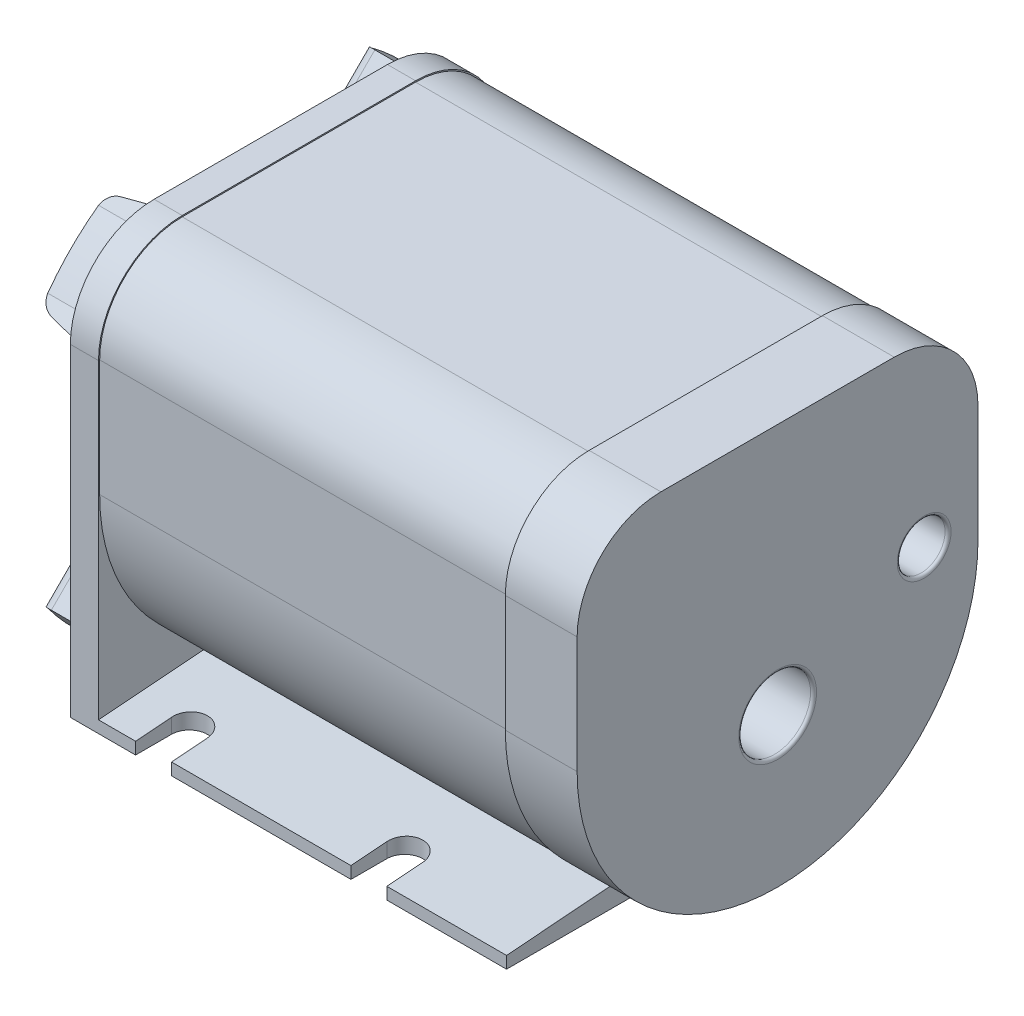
from build123d import *

# Parameters (mm, degrees)
EXTRUSION1_DEPTH             = 6
EXTRUSION3_DEPTH             = 34
EXTRUSION4_DEPTH             = 2.35
EXTRUSION5_START             = 34.1
EXTRUSION5_DEPTH             = 34.1
EXTRUSION6_DEPTH             = 3
EXTRUSION7_DEPTH             = 6
ESQUISSE8_R                  = 15
ENL_V_MAT_EXTRU_1_DEPTH      = 5
R_P_TITION_CIRCULAIRE3_COUNT = 4
ENL_V_MAT_EXTRU_2_DEPTH      = 5
ESQUISSE10_R                 = 3
ESQUISSE10_R_2               = 2
ENL_V_MAT_EXTRU_3_DEPTH      = 10
CONG_1_R                     = 0.25


with BuildPart() as part:
    # Esquisse1 → Extrusion1 (new body)
    with BuildSketch(Plane(origin=(0, 0, 0), x_dir=(0, 0, -1), z_dir=(1, 0, 0))):
        with BuildLine():
            Line((33.5, 26.5), (33.5, 16.769466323))
            ThreePointArc((33.5, 16.769466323), (16.759138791, 0.010327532), (0, 16.751188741))
            Line((0, 16.751188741), (0, 26.5))
            ThreePointArc((0, 26.5), (2.050252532, 31.449747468), (7, 33.5))
            Line((7, 33.5), (26.5, 33.5))
            ThreePointArc((26.5, 33.5), (31.449747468, 31.449747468), (33.5, 26.5))
        make_face()
    extrude(amount=-EXTRUSION1_DEPTH)

    # Esquisse3 → Extrusion3 (add)
    with BuildSketch(Plane.ZY.offset(6)):
        with BuildLine():
            Line((-7, 33.4), (-26.5, 33.4))
            ThreePointArc((-26.5, 33.4), (-31.37903679, 31.37903679), (-33.4, 26.5))
            Line((-33.4, 26.5), (-33.400000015, 16.769411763))
            ThreePointArc((-33.400000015, 16.769411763), (-16.759111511, 0.110327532), (-0.1, 16.751188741))
            Line((-0.1, 16.751188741), (-0.1, 26.5))
            ThreePointArc((-0.1, 26.5), (-2.12096321, 31.37903679), (-7, 33.4))
        make_face()
    extrude(amount=EXTRUSION3_DEPTH)

    # Esquisse4 → Extrusion4 (add)
    with BuildSketch(Plane.ZY.offset(40)):
        with BuildLine():
            Line((0, 16.760327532), (0, 26.5))
            ThreePointArc((0, 26.5), (-2.050252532, 31.449747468), (-7, 33.5))
            Line((-7, 33.5), (-26.5, 33.5))
            ThreePointArc((-26.5, 33.5), (-31.449747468, 31.449747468), (-33.5, 26.5))
            Line((-33.5, 26.5), (-33.5, 16.760327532))
            ThreePointArc((-33.5, 16.760327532), (-16.75, 0.010327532), (0, 16.760327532))
        make_face()
        with BuildLine():
            Line((0, -0.5), (0, 16.760327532))
            ThreePointArc((0, 16.760327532), (-16.75, 0.010327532), (-33.5, 16.760327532))
            Line((-33.5, 16.760327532), (-33.5, -0.5))
            Line((-33.5, -0.5), (0, -0.5))
        make_face()
    extrude(amount=EXTRUSION4_DEPTH)

    # Esquisse5 → Extrusion5 (add)
    with BuildSketch(Plane(origin=(-40, 0, 0), x_dir=(0, 0, -1), z_dir=(1, 0, 0)).offset(EXTRUSION5_START)):
        with BuildLine():
            Line((0, -0.5), (33.5, -0.5))
            Line((33.5, -0.5), (33.5, 0.5))
            Line((33.5, 0.5), (23.195219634, 1.3))
            ThreePointArc((23.195219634, 1.3), (16.75, 0.010325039), (10.304780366, 1.3))
            Line((10.304780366, 1.3), (0, 0.5))
            Line((0, 0.5), (0, -0.5))
        make_face()
    extrude(amount=-EXTRUSION5_DEPTH)

    # Esquisse6 → Extrusion6 (add)
    with BuildSketch(Plane.ZY.offset(42.35)):
        with BuildLine():
            Line((-4.236374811, 25.020984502), (-1.111607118, 28.145752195))
            ThreePointArc((-1.111607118, 28.145752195), (-3.067483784, 30.432516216), (-5.354247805, 32.388392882))
            Line((-5.354247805, 32.388392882), (-8.479015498, 29.263625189))
            ThreePointArc((-8.479015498, 29.263625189), (-6.143398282, 27.356601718), (-4.236374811, 25.020984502))
        make_face()
    extrusion6 = extrude(amount=EXTRUSION6_DEPTH)

    # Esquisse7 → Extrusion7 (add)
    with BuildSketch(Plane(origin=(0, 13.517072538, 13.517072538), x_dir=(-1, 0, 0), z_dir=(0, -0.7071067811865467, -0.7071067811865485))):
        with BuildLine():
            Line((42.35, 20.68807717), (45.35, 20.68807717))
            ThreePointArc((45.35, 20.68807717), (44.979207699, 19.984088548), (44.281852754, 19.600965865))
            Line((44.281852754, 19.600965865), (42.35, 19.18807717))
            Line((42.35, 19.18807717), (42.35, 20.68807717))
        make_face()
        with BuildLine():
            Line((42.35, 28.18807717), (44.281852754, 27.775188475))
            ThreePointArc((44.281852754, 27.775188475), (44.979207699, 27.392065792), (45.35, 26.68807717))
            Line((45.35, 26.68807717), (42.35, 26.68807717))
            Line((42.35, 26.68807717), (42.35, 28.18807717))
        make_face()
    extrusion7 = extrude(amount=EXTRUSION7_DEPTH)

    # Esquisse8 → Enl_v. mat.-Extru.1 (cut)
    with BuildSketch(Plane.ZY.offset(42.35)):
        with Locations((-16.75, 16.75)):
            Circle(ESQUISSE8_R)
    enl_v_mat_extru_1 = extrude(amount=ENL_V_MAT_EXTRU_1_DEPTH, mode=Mode.SUBTRACT)

    # R_p_tition circulaire3: Extrusion6, Extrusion7, Enl_v. mat.-Extru.1 ×4 about axis
    r_p_tition_circulaire3_axis = Axis((0, 16.75, -16.75), (1, 0, 0))
    add([extrusion6.rotate(r_p_tition_circulaire3_axis, i * 360 / R_P_TITION_CIRCULAIRE3_COUNT) for i in range(1, R_P_TITION_CIRCULAIRE3_COUNT)])
    add([extrusion7.rotate(r_p_tition_circulaire3_axis, i * 360 / R_P_TITION_CIRCULAIRE3_COUNT) for i in range(1, R_P_TITION_CIRCULAIRE3_COUNT)])
    add([enl_v_mat_extru_1.rotate(r_p_tition_circulaire3_axis, i * 360 / R_P_TITION_CIRCULAIRE3_COUNT) for i in range(1, R_P_TITION_CIRCULAIRE3_COUNT)], mode=Mode.SUBTRACT)

    # Esquisse9 → Enl_v. mat.-Extru.2 (cut)
    with BuildSketch(Plane.XZ.offset(0.5)):
        with BuildLine():
            Line((-15.9, -30.5), (-15.9, -33.5))
            Line((-15.9, -33.5), (-18.9, -33.5))
            Line((-18.9, -33.5), (-18.9, -30.5))
            ThreePointArc((-18.9, -30.5), (-17.4, -29), (-15.9, -30.5))
        make_face()
        with BuildLine():
            Line((-33.9, -30.5), (-33.9, -33.5))
            Line((-33.9, -33.5), (-36.9, -33.5))
            Line((-36.9, -33.5), (-36.9, -30.5))
            ThreePointArc((-36.9, -30.5), (-35.4, -29), (-33.9, -30.5))
        make_face()
        with BuildLine():
            Line((-33.9, 0), (-36.9, 0))
            Line((-36.9, 0), (-36.9, -3))
            ThreePointArc((-36.9, -3), (-35.4, -4.5), (-33.9, -3))
            Line((-33.9, -3), (-33.9, 0))
        make_face()
        with BuildLine():
            Line((-15.9, 0), (-18.9, 0))
            Line((-18.9, 0), (-18.9, -3))
            ThreePointArc((-18.9, -3), (-17.4, -4.5), (-15.9, -3))
            Line((-15.9, -3), (-15.9, 0))
        make_face()
    extrude(amount=-ENL_V_MAT_EXTRU_2_DEPTH, mode=Mode.SUBTRACT)

    # Esquisse10 → Enl_v. mat.-Extru.3 (cut)
    with BuildSketch(Plane(origin=(0, 0, 0), x_dir=(0, 0, -1), z_dir=(1, 0, 0))):
        with Locations((16.755576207, 12.5)):
            Circle(ESQUISSE10_R)
        with Locations((29, 18.5)):
            Circle(ESQUISSE10_R_2)
    extrude(amount=-ENL_V_MAT_EXTRU_3_DEPTH, mode=Mode.SUBTRACT)

    # Cong_1
    cong_1_edges = [part.edges().sort_by_distance(p)[0] for p in [
        (0, 12.5, -13.755576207),
        (0, 18.5, -27),
    ]]
    fillet(cong_1_edges, radius=CONG_1_R)


solid = part.part
